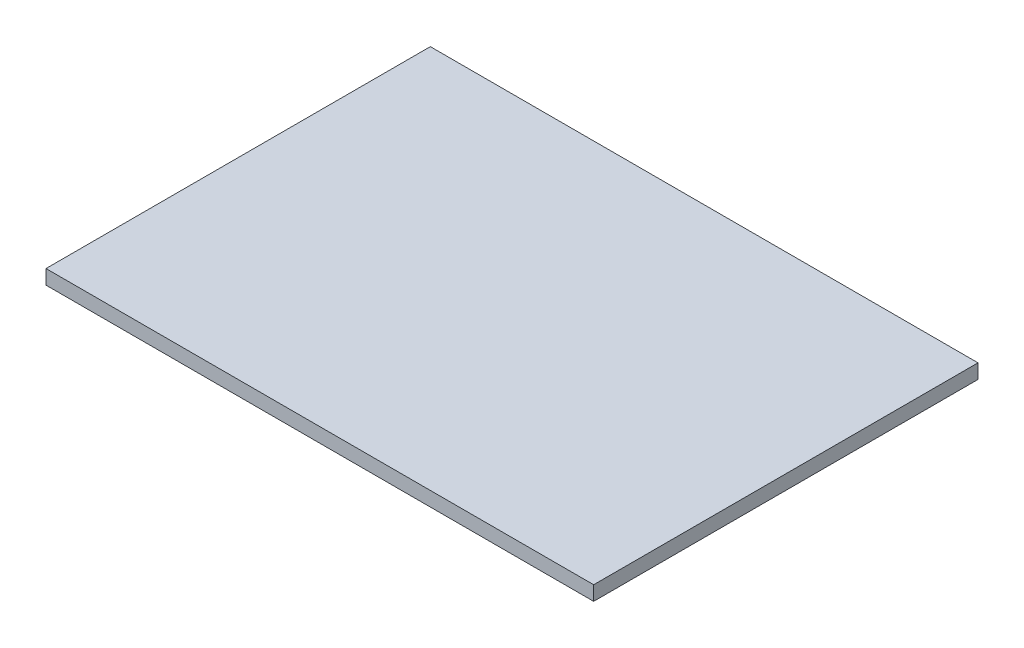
ISO-10303-21;
HEADER;
FILE_DESCRIPTION(('STEP AP214'),'2;1');
FILE_NAME('part.step','',(''),(''),'','','');
FILE_SCHEMA(('AUTOMOTIVE_DESIGN { 1 0 10303 214 1 1 1 1 }'));
ENDSEC;
DATA;
#1=APPLICATION_CONTEXT('core data for automotive mechanical design processes');
#2=APPLICATION_PROTOCOL_DEFINITION('international standard','automotive_design',2000,#1);
#3=PRODUCT_CONTEXT('',#1,'mechanical');
#4=PRODUCT('Part','Part','',(#3));
#5=PRODUCT_RELATED_PRODUCT_CATEGORY('part','',(#4));
#6=PRODUCT_DEFINITION_FORMATION('','',#4);
#7=PRODUCT_DEFINITION_CONTEXT('part definition',#1,'design');
#8=PRODUCT_DEFINITION('design','',#6,#7);
#9=PRODUCT_DEFINITION_SHAPE('','',#8);
#10=(LENGTH_UNIT() NAMED_UNIT(*) SI_UNIT(.MILLI.,.METRE.));
#11=(NAMED_UNIT(*) PLANE_ANGLE_UNIT() SI_UNIT($,.RADIAN.));
#12=(NAMED_UNIT(*) SI_UNIT($,.STERADIAN.) SOLID_ANGLE_UNIT());
#13=UNCERTAINTY_MEASURE_WITH_UNIT(LENGTH_MEASURE(1.E-05),#10,'distance_accuracy_value','');
#14=(GEOMETRIC_REPRESENTATION_CONTEXT(3) GLOBAL_UNCERTAINTY_ASSIGNED_CONTEXT((#13)) GLOBAL_UNIT_ASSIGNED_CONTEXT((#10,
#11,#12)) REPRESENTATION_CONTEXT('',''));
#15=CARTESIAN_POINT('',(0.,0.,0.));
#16=DIRECTION('',(0.,0.,1.));
#17=DIRECTION('',(1.,0.,0.));
#18=AXIS2_PLACEMENT_3D('',#15,#16,#17);
#19=CARTESIAN_POINT('',(0.,4.7625,0.));
#20=DIRECTION('',(1.,0.,0.));
#21=DIRECTION('',(0.,0.,-1.));
#22=AXIS2_PLACEMENT_3D('',#19,#20,#21);
#23=PLANE('',#22);
#24=DIRECTION('',(0.,0.,1.));
#25=VECTOR('',#24,1.);
#26=CARTESIAN_POINT('',(0.,0.,0.));
#27=LINE('',#26,#25);
#28=CARTESIAN_POINT('',(0.,0.,-127.));
#29=VERTEX_POINT('',#28);
#30=CARTESIAN_POINT('',(0.,0.,0.));
#31=VERTEX_POINT('',#30);
#32=EDGE_CURVE('E96',#29,#31,#27,.T.);
#33=ORIENTED_EDGE('',*,*,#32,.T.);
#34=DIRECTION('',(0.,-1.,0.));
#35=VECTOR('',#34,1.);
#36=CARTESIAN_POINT('',(0.,4.7625,0.));
#37=LINE('',#36,#35);
#38=CARTESIAN_POINT('',(0.,4.7625,0.));
#39=VERTEX_POINT('',#38);
#40=EDGE_CURVE('E11',#39,#31,#37,.T.);
#41=ORIENTED_EDGE('',*,*,#40,.F.);
#42=DIRECTION('',(0.,0.,1.));
#43=VECTOR('',#42,1.);
#44=CARTESIAN_POINT('',(0.,4.7625,0.));
#45=LINE('',#44,#43);
#46=CARTESIAN_POINT('',(0.,4.7625,-127.));
#47=VERTEX_POINT('',#46);
#48=EDGE_CURVE('E84',#47,#39,#45,.T.);
#49=ORIENTED_EDGE('',*,*,#48,.F.);
#50=DIRECTION('',(0.,-1.,0.));
#51=VECTOR('',#50,1.);
#52=CARTESIAN_POINT('',(0.,4.7625,-127.));
#53=LINE('',#52,#51);
#54=EDGE_CURVE('E92',#47,#29,#53,.T.);
#55=ORIENTED_EDGE('',*,*,#54,.T.);
#56=EDGE_LOOP('',(#33,#41,#49,#55));
#57=FACE_BOUND('',#56,.T.);
#58=ADVANCED_FACE('F33',(#57),#23,.F.);
#59=CARTESIAN_POINT('',(0.,4.7625,0.));
#60=DIRECTION('',(0.,0.,-1.));
#61=DIRECTION('',(-1.,0.,0.));
#62=AXIS2_PLACEMENT_3D('',#59,#60,#61);
#63=PLANE('',#62);
#64=DIRECTION('',(1.,0.,0.));
#65=VECTOR('',#64,1.);
#66=CARTESIAN_POINT('',(0.,0.,0.));
#67=LINE('',#66,#65);
#68=CARTESIAN_POINT('',(180.975,0.,0.));
#69=VERTEX_POINT('',#68);
#70=EDGE_CURVE('E88',#31,#69,#67,.T.);
#71=ORIENTED_EDGE('',*,*,#70,.T.);
#72=DIRECTION('',(0.,-1.,0.));
#73=VECTOR('',#72,1.);
#74=CARTESIAN_POINT('',(180.975,4.7625,0.));
#75=LINE('',#74,#73);
#76=CARTESIAN_POINT('',(180.975,4.7625,0.));
#77=VERTEX_POINT('',#76);
#78=EDGE_CURVE('E41',#77,#69,#75,.T.);
#79=ORIENTED_EDGE('',*,*,#78,.F.);
#80=DIRECTION('',(1.,0.,0.));
#81=VECTOR('',#80,1.);
#82=CARTESIAN_POINT('',(0.,4.7625,0.));
#83=LINE('',#82,#81);
#84=EDGE_CURVE('E79',#39,#77,#83,.T.);
#85=ORIENTED_EDGE('',*,*,#84,.F.);
#86=ORIENTED_EDGE('',*,*,#40,.T.);
#87=EDGE_LOOP('',(#71,#79,#85,#86));
#88=FACE_BOUND('',#87,.T.);
#89=ADVANCED_FACE('F87',(#88),#63,.F.);
#90=CARTESIAN_POINT('',(180.975,4.7625,0.));
#91=DIRECTION('',(-1.,0.,0.));
#92=DIRECTION('',(0.,0.,1.));
#93=AXIS2_PLACEMENT_3D('',#90,#91,#92);
#94=PLANE('',#93);
#95=DIRECTION('',(0.,0.,-1.));
#96=VECTOR('',#95,1.);
#97=CARTESIAN_POINT('',(180.975,0.,0.));
#98=LINE('',#97,#96);
#99=CARTESIAN_POINT('',(180.975,0.,-127.));
#100=VERTEX_POINT('',#99);
#101=EDGE_CURVE('E66',#69,#100,#98,.T.);
#102=ORIENTED_EDGE('',*,*,#101,.T.);
#103=DIRECTION('',(0.,-1.,0.));
#104=VECTOR('',#103,1.);
#105=CARTESIAN_POINT('',(180.975,4.7625,-127.));
#106=LINE('',#105,#104);
#107=CARTESIAN_POINT('',(180.975,4.7625,-127.));
#108=VERTEX_POINT('',#107);
#109=EDGE_CURVE('E89',#108,#100,#106,.T.);
#110=ORIENTED_EDGE('',*,*,#109,.F.);
#111=DIRECTION('',(0.,0.,-1.));
#112=VECTOR('',#111,1.);
#113=CARTESIAN_POINT('',(180.975,4.7625,0.));
#114=LINE('',#113,#112);
#115=EDGE_CURVE('E82',#77,#108,#114,.T.);
#116=ORIENTED_EDGE('',*,*,#115,.F.);
#117=ORIENTED_EDGE('',*,*,#78,.T.);
#118=EDGE_LOOP('',(#102,#110,#116,#117));
#119=FACE_BOUND('',#118,.T.);
#120=ADVANCED_FACE('F90',(#119),#94,.F.);
#121=CARTESIAN_POINT('',(0.,4.7625,-127.));
#122=DIRECTION('',(0.,0.,1.));
#123=DIRECTION('',(1.,0.,0.));
#124=AXIS2_PLACEMENT_3D('',#121,#122,#123);
#125=PLANE('',#124);
#126=DIRECTION('',(-1.,0.,0.));
#127=VECTOR('',#126,1.);
#128=CARTESIAN_POINT('',(0.,0.,-127.));
#129=LINE('',#128,#127);
#130=EDGE_CURVE('E72',#100,#29,#129,.T.);
#131=ORIENTED_EDGE('',*,*,#130,.T.);
#132=ORIENTED_EDGE('',*,*,#54,.F.);
#133=DIRECTION('',(-1.,0.,0.));
#134=VECTOR('',#133,1.);
#135=CARTESIAN_POINT('',(0.,4.7625,-127.));
#136=LINE('',#135,#134);
#137=EDGE_CURVE('E49',#108,#47,#136,.T.);
#138=ORIENTED_EDGE('',*,*,#137,.F.);
#139=ORIENTED_EDGE('',*,*,#109,.T.);
#140=EDGE_LOOP('',(#131,#132,#138,#139));
#141=FACE_BOUND('',#140,.T.);
#142=ADVANCED_FACE('F103',(#141),#125,.F.);
#143=CARTESIAN_POINT('',(0.,4.7625,0.));
#144=DIRECTION('',(0.,-1.,0.));
#145=DIRECTION('',(0.,0.,-1.));
#146=AXIS2_PLACEMENT_3D('',#143,#144,#145);
#147=PLANE('',#146);
#148=ORIENTED_EDGE('',*,*,#48,.T.);
#149=ORIENTED_EDGE('',*,*,#84,.T.);
#150=ORIENTED_EDGE('',*,*,#115,.T.);
#151=ORIENTED_EDGE('',*,*,#137,.T.);
#152=EDGE_LOOP('',(#148,#149,#150,#151));
#153=FACE_BOUND('',#152,.T.);
#154=ADVANCED_FACE('F80',(#153),#147,.F.);
#155=CARTESIAN_POINT('',(0.,0.,0.));
#156=DIRECTION('',(0.,-1.,0.));
#157=DIRECTION('',(0.,0.,-1.));
#158=AXIS2_PLACEMENT_3D('',#155,#156,#157);
#159=PLANE('',#158);
#160=ORIENTED_EDGE('',*,*,#32,.F.);
#161=ORIENTED_EDGE('',*,*,#130,.F.);
#162=ORIENTED_EDGE('',*,*,#101,.F.);
#163=ORIENTED_EDGE('',*,*,#70,.F.);
#164=EDGE_LOOP('',(#160,#161,#162,#163));
#165=FACE_BOUND('',#164,.T.);
#166=ADVANCED_FACE('F106',(#165),#159,.T.);
#167=CLOSED_SHELL('',(#58,#89,#120,#142,#154,#166));
#168=MANIFOLD_SOLID_BREP('B2',#167);
#169=ADVANCED_BREP_SHAPE_REPRESENTATION('',(#18,#168),#14);
#170=SHAPE_DEFINITION_REPRESENTATION(#9,#169);
ENDSEC;
END-ISO-10303-21;
